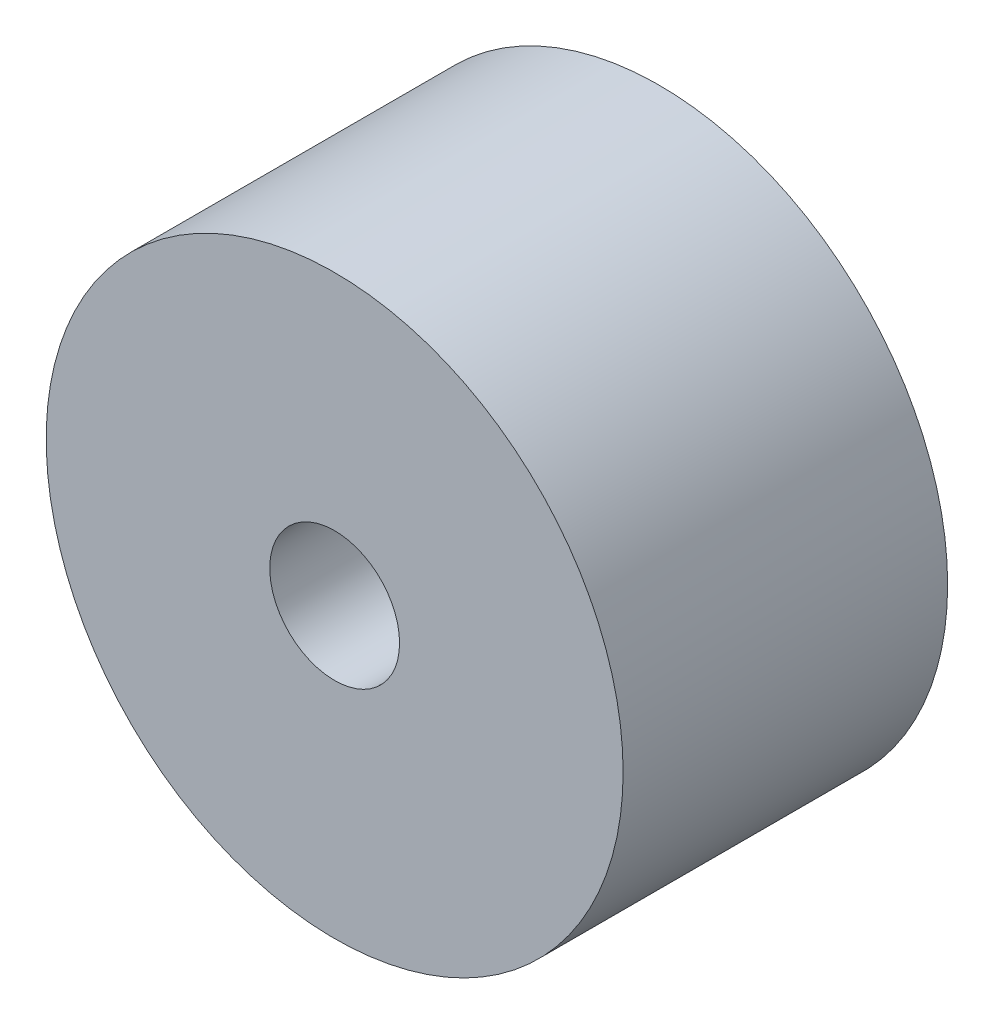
from build123d import *

# Parameters (mm, degrees)
SKETCH1_R           = 4
SKETCH1_R_2         = 0.9
BOSS_EXTRUDE1_DEPTH = 4.5


with BuildPart() as part:
    # Sketch1 → Boss-Extrude1 (new body)
    with BuildSketch(Plane.XY):
        Circle(SKETCH1_R)
        Circle(SKETCH1_R_2, mode=Mode.SUBTRACT)
    extrude(amount=BOSS_EXTRUDE1_DEPTH)


solid = part.part
